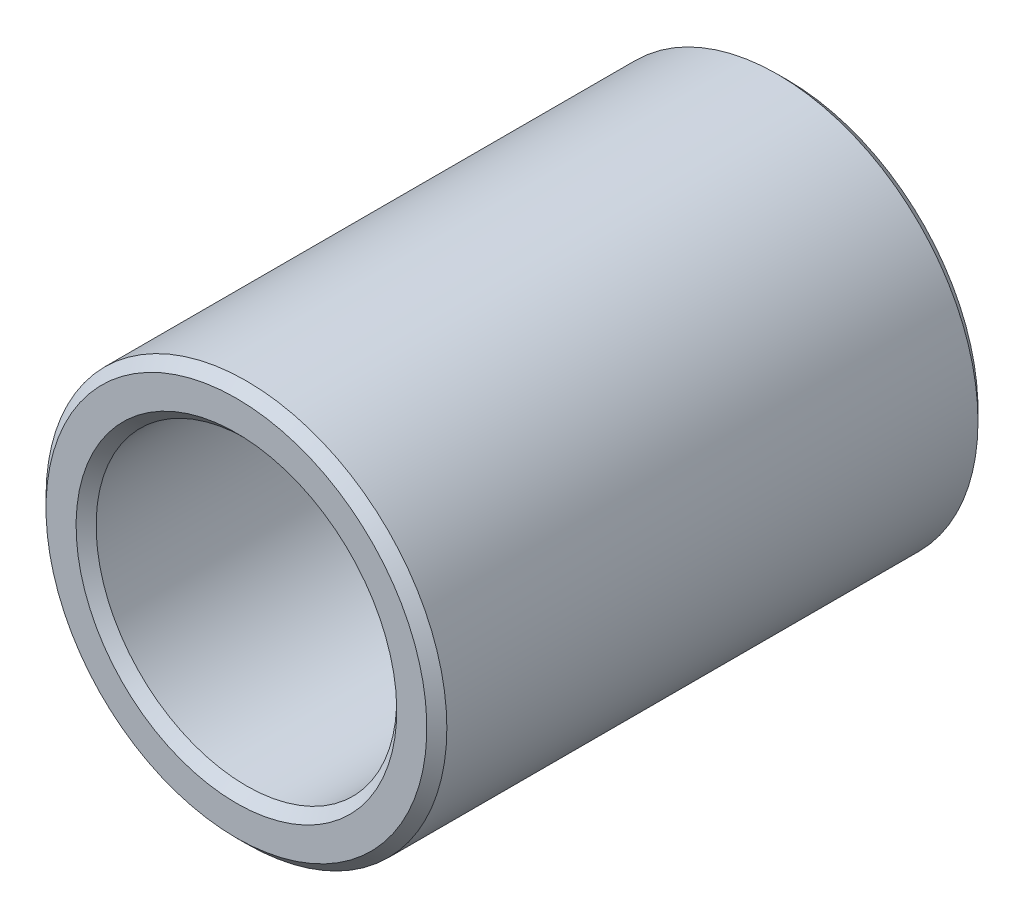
ISO-10303-21;
HEADER;
FILE_DESCRIPTION(('STEP AP214'),'2;1');
FILE_NAME('part.step','',(''),(''),'','','');
FILE_SCHEMA(('AUTOMOTIVE_DESIGN { 1 0 10303 214 1 1 1 1 }'));
ENDSEC;
DATA;
#1=APPLICATION_CONTEXT('core data for automotive mechanical design processes');
#2=APPLICATION_PROTOCOL_DEFINITION('international standard','automotive_design',2000,#1);
#3=PRODUCT_CONTEXT('',#1,'mechanical');
#4=PRODUCT('Part','Part','',(#3));
#5=PRODUCT_RELATED_PRODUCT_CATEGORY('part','',(#4));
#6=PRODUCT_DEFINITION_FORMATION('','',#4);
#7=PRODUCT_DEFINITION_CONTEXT('part definition',#1,'design');
#8=PRODUCT_DEFINITION('design','',#6,#7);
#9=PRODUCT_DEFINITION_SHAPE('','',#8);
#10=(LENGTH_UNIT() NAMED_UNIT(*) SI_UNIT(.MILLI.,.METRE.));
#11=(NAMED_UNIT(*) PLANE_ANGLE_UNIT() SI_UNIT($,.RADIAN.));
#12=(NAMED_UNIT(*) SI_UNIT($,.STERADIAN.) SOLID_ANGLE_UNIT());
#13=UNCERTAINTY_MEASURE_WITH_UNIT(LENGTH_MEASURE(1.E-05),#10,'distance_accuracy_value','');
#14=(GEOMETRIC_REPRESENTATION_CONTEXT(3) GLOBAL_UNCERTAINTY_ASSIGNED_CONTEXT((#13)) GLOBAL_UNIT_ASSIGNED_CONTEXT((#10,
#11,#12)) REPRESENTATION_CONTEXT('',''));
#15=CARTESIAN_POINT('',(0.,0.,0.));
#16=DIRECTION('',(0.,0.,1.));
#17=DIRECTION('',(1.,0.,0.));
#18=AXIS2_PLACEMENT_3D('',#15,#16,#17);
#19=CARTESIAN_POINT('',(0.,0.,0.));
#20=DIRECTION('',(0.,0.,-1.));
#21=DIRECTION('',(0.,1.,0.));
#22=AXIS2_PLACEMENT_3D('',#19,#20,#21);
#23=CYLINDRICAL_SURFACE('',#22,3.);
#24=CARTESIAN_POINT('',(0.,0.,0.2));
#25=DIRECTION('',(0.,0.,-1.));
#26=DIRECTION('',(0.,1.,0.));
#27=AXIS2_PLACEMENT_3D('',#24,#25,#26);
#28=CIRCLE('',#27,3.);
#29=CARTESIAN_POINT('',(0.,3.,0.2));
#30=VERTEX_POINT('',#29);
#31=EDGE_CURVE('E38',#30,#30,#28,.T.);
#32=ORIENTED_EDGE('',*,*,#31,.T.);
#33=EDGE_LOOP('',(#32));
#34=FACE_BOUND('',#33,.T.);
#35=CARTESIAN_POINT('',(0.,0.,10.8));
#36=DIRECTION('',(0.,0.,1.));
#37=DIRECTION('',(0.,-1.,0.));
#38=AXIS2_PLACEMENT_3D('',#35,#36,#37);
#39=CIRCLE('',#38,3.);
#40=CARTESIAN_POINT('',(0.,-3.,10.8));
#41=VERTEX_POINT('',#40);
#42=EDGE_CURVE('E41',#41,#41,#39,.T.);
#43=ORIENTED_EDGE('',*,*,#42,.T.);
#44=EDGE_LOOP('',(#43));
#45=FACE_BOUND('',#44,.T.);
#46=ADVANCED_FACE('F12',(#34,#45),#23,.F.);
#47=CARTESIAN_POINT('',(3.,0.,11.));
#48=DIRECTION('',(0.,0.,1.));
#49=DIRECTION('',(0.,-1.,0.));
#50=AXIS2_PLACEMENT_3D('',#47,#48,#49);
#51=PLANE('',#50);
#52=CARTESIAN_POINT('',(0.,0.,11.));
#53=DIRECTION('',(0.,0.,1.));
#54=DIRECTION('',(0.,-1.,0.));
#55=AXIS2_PLACEMENT_3D('',#52,#53,#54);
#56=CIRCLE('',#55,3.8);
#57=CARTESIAN_POINT('',(0.,-3.8,11.));
#58=VERTEX_POINT('',#57);
#59=EDGE_CURVE('E8',#58,#58,#56,.T.);
#60=ORIENTED_EDGE('',*,*,#59,.T.);
#61=EDGE_LOOP('',(#60));
#62=FACE_BOUND('',#61,.T.);
#63=CARTESIAN_POINT('',(0.,0.,11.));
#64=DIRECTION('',(0.,0.,1.));
#65=DIRECTION('',(0.,-1.,0.));
#66=AXIS2_PLACEMENT_3D('',#63,#64,#65);
#67=CIRCLE('',#66,3.2);
#68=CARTESIAN_POINT('',(0.,-3.2,11.));
#69=VERTEX_POINT('',#68);
#70=EDGE_CURVE('E32',#69,#69,#67,.F.);
#71=ORIENTED_EDGE('',*,*,#70,.T.);
#72=EDGE_LOOP('',(#71));
#73=FACE_BOUND('',#72,.T.);
#74=ADVANCED_FACE('F54',(#62,#73),#51,.T.);
#75=CARTESIAN_POINT('',(0.,0.,0.));
#76=DIRECTION('',(0.,0.,-1.));
#77=DIRECTION('',(0.,1.,0.));
#78=AXIS2_PLACEMENT_3D('',#75,#76,#77);
#79=CYLINDRICAL_SURFACE('',#78,4.);
#80=CARTESIAN_POINT('',(0.,0.,0.200000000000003));
#81=DIRECTION('',(0.,0.,-1.));
#82=DIRECTION('',(0.,1.,0.));
#83=AXIS2_PLACEMENT_3D('',#80,#81,#82);
#84=CIRCLE('',#83,4.);
#85=CARTESIAN_POINT('',(0.,4.,0.200000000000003));
#86=VERTEX_POINT('',#85);
#87=EDGE_CURVE('E19',#86,#86,#84,.F.);
#88=ORIENTED_EDGE('',*,*,#87,.T.);
#89=EDGE_LOOP('',(#88));
#90=FACE_BOUND('',#89,.T.);
#91=CARTESIAN_POINT('',(0.,0.,10.8));
#92=DIRECTION('',(0.,0.,1.));
#93=DIRECTION('',(0.,-1.,0.));
#94=AXIS2_PLACEMENT_3D('',#91,#92,#93);
#95=CIRCLE('',#94,4.);
#96=CARTESIAN_POINT('',(0.,-4.,10.8));
#97=VERTEX_POINT('',#96);
#98=EDGE_CURVE('E23',#97,#97,#95,.F.);
#99=ORIENTED_EDGE('',*,*,#98,.T.);
#100=EDGE_LOOP('',(#99));
#101=FACE_BOUND('',#100,.T.);
#102=ADVANCED_FACE('F56',(#90,#101),#79,.T.);
#103=CARTESIAN_POINT('',(3.,0.,0.));
#104=DIRECTION('',(0.,0.,-1.));
#105=DIRECTION('',(0.,1.,0.));
#106=AXIS2_PLACEMENT_3D('',#103,#104,#105);
#107=PLANE('',#106);
#108=CARTESIAN_POINT('',(0.,0.,0.));
#109=DIRECTION('',(0.,0.,-1.));
#110=DIRECTION('',(0.,1.,0.));
#111=AXIS2_PLACEMENT_3D('',#108,#109,#110);
#112=CIRCLE('',#111,3.8);
#113=CARTESIAN_POINT('',(0.,3.8,0.));
#114=VERTEX_POINT('',#113);
#115=EDGE_CURVE('E27',#114,#114,#112,.T.);
#116=ORIENTED_EDGE('',*,*,#115,.T.);
#117=EDGE_LOOP('',(#116));
#118=FACE_BOUND('',#117,.T.);
#119=CARTESIAN_POINT('',(0.,0.,0.));
#120=DIRECTION('',(0.,0.,-1.));
#121=DIRECTION('',(0.,1.,0.));
#122=AXIS2_PLACEMENT_3D('',#119,#120,#121);
#123=CIRCLE('',#122,3.2);
#124=CARTESIAN_POINT('',(0.,3.2,0.));
#125=VERTEX_POINT('',#124);
#126=EDGE_CURVE('E35',#125,#125,#123,.F.);
#127=ORIENTED_EDGE('',*,*,#126,.T.);
#128=EDGE_LOOP('',(#127));
#129=FACE_BOUND('',#128,.T.);
#130=ADVANCED_FACE('F63',(#118,#129),#107,.T.);
#131=CARTESIAN_POINT('',(0.,0.,0.2));
#132=DIRECTION('',(0.,0.,-1.));
#133=DIRECTION('',(0.,1.,0.));
#134=AXIS2_PLACEMENT_3D('',#131,#132,#133);
#135=CONICAL_SURFACE('',#134,3.,0.785398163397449);
#136=ORIENTED_EDGE('',*,*,#126,.F.);
#137=EDGE_LOOP('',(#136));
#138=FACE_BOUND('',#137,.T.);
#139=ORIENTED_EDGE('',*,*,#31,.F.);
#140=EDGE_LOOP('',(#139));
#141=FACE_BOUND('',#140,.T.);
#142=ADVANCED_FACE('F50',(#138,#141),#135,.F.);
#143=CARTESIAN_POINT('',(0.,0.,11.));
#144=DIRECTION('',(0.,0.,1.));
#145=DIRECTION('',(0.,-1.,0.));
#146=AXIS2_PLACEMENT_3D('',#143,#144,#145);
#147=CONICAL_SURFACE('',#146,3.2,0.785398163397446);
#148=ORIENTED_EDGE('',*,*,#42,.F.);
#149=EDGE_LOOP('',(#148));
#150=FACE_BOUND('',#149,.T.);
#151=ORIENTED_EDGE('',*,*,#70,.F.);
#152=EDGE_LOOP('',(#151));
#153=FACE_BOUND('',#152,.T.);
#154=ADVANCED_FACE('F46',(#150,#153),#147,.F.);
#155=CARTESIAN_POINT('',(0.,0.,0.));
#156=DIRECTION('',(0.,0.,1.));
#157=DIRECTION('',(0.,-1.,0.));
#158=AXIS2_PLACEMENT_3D('',#155,#156,#157);
#159=CONICAL_SURFACE('',#158,3.8,0.785398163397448);
#160=ORIENTED_EDGE('',*,*,#87,.F.);
#161=EDGE_LOOP('',(#160));
#162=FACE_BOUND('',#161,.T.);
#163=ORIENTED_EDGE('',*,*,#115,.F.);
#164=EDGE_LOOP('',(#163));
#165=FACE_BOUND('',#164,.T.);
#166=ADVANCED_FACE('F49',(#162,#165),#159,.T.);
#167=CARTESIAN_POINT('',(0.,0.,10.8));
#168=DIRECTION('',(0.,0.,-1.));
#169=DIRECTION('',(0.,1.,0.));
#170=AXIS2_PLACEMENT_3D('',#167,#168,#169);
#171=CONICAL_SURFACE('',#170,4.,0.785398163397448);
#172=ORIENTED_EDGE('',*,*,#59,.F.);
#173=EDGE_LOOP('',(#172));
#174=FACE_BOUND('',#173,.T.);
#175=ORIENTED_EDGE('',*,*,#98,.F.);
#176=EDGE_LOOP('',(#175));
#177=FACE_BOUND('',#176,.T.);
#178=ADVANCED_FACE('F14',(#174,#177),#171,.T.);
#179=CLOSED_SHELL('',(#46,#74,#102,#130,#142,#154,#166,#178));
#180=MANIFOLD_SOLID_BREP('B1',#179);
#181=ADVANCED_BREP_SHAPE_REPRESENTATION('',(#18,#180),#14);
#182=SHAPE_DEFINITION_REPRESENTATION(#9,#181);
ENDSEC;
END-ISO-10303-21;
